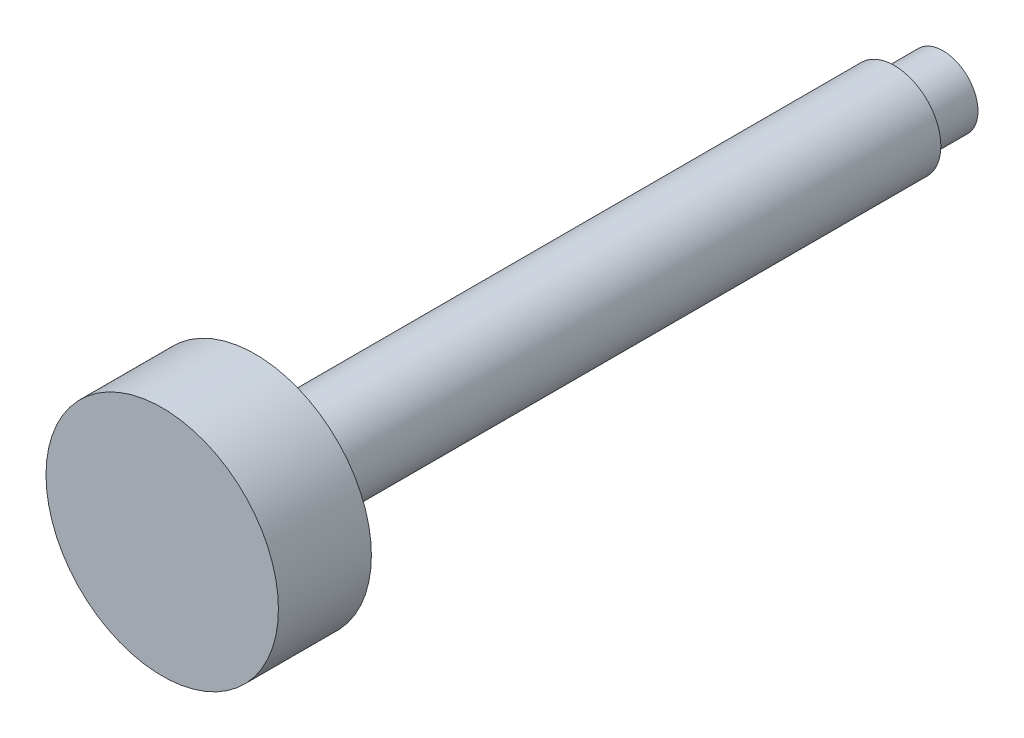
ISO-10303-21;
HEADER;
FILE_DESCRIPTION(('STEP AP214'),'2;1');
FILE_NAME('part.step','',(''),(''),'','','');
FILE_SCHEMA(('AUTOMOTIVE_DESIGN { 1 0 10303 214 1 1 1 1 }'));
ENDSEC;
DATA;
#1=APPLICATION_CONTEXT('core data for automotive mechanical design processes');
#2=APPLICATION_PROTOCOL_DEFINITION('international standard','automotive_design',2000,#1);
#3=PRODUCT_CONTEXT('',#1,'mechanical');
#4=PRODUCT('Part','Part','',(#3));
#5=PRODUCT_RELATED_PRODUCT_CATEGORY('part','',(#4));
#6=PRODUCT_DEFINITION_FORMATION('','',#4);
#7=PRODUCT_DEFINITION_CONTEXT('part definition',#1,'design');
#8=PRODUCT_DEFINITION('design','',#6,#7);
#9=PRODUCT_DEFINITION_SHAPE('','',#8);
#10=(LENGTH_UNIT() NAMED_UNIT(*) SI_UNIT(.MILLI.,.METRE.));
#11=(NAMED_UNIT(*) PLANE_ANGLE_UNIT() SI_UNIT($,.RADIAN.));
#12=(NAMED_UNIT(*) SI_UNIT($,.STERADIAN.) SOLID_ANGLE_UNIT());
#13=UNCERTAINTY_MEASURE_WITH_UNIT(LENGTH_MEASURE(1.E-05),#10,'distance_accuracy_value','');
#14=(GEOMETRIC_REPRESENTATION_CONTEXT(3) GLOBAL_UNCERTAINTY_ASSIGNED_CONTEXT((#13)) GLOBAL_UNIT_ASSIGNED_CONTEXT((#10,
#11,#12)) REPRESENTATION_CONTEXT('',''));
#15=CARTESIAN_POINT('',(0.,0.,0.));
#16=DIRECTION('',(0.,0.,1.));
#17=DIRECTION('',(1.,0.,0.));
#18=AXIS2_PLACEMENT_3D('',#15,#16,#17);
#19=CARTESIAN_POINT('',(0.,0.,6.));
#20=DIRECTION('',(0.,0.,1.));
#21=DIRECTION('',(1.,0.,0.));
#22=AXIS2_PLACEMENT_3D('',#19,#20,#21);
#23=SPHERICAL_SURFACE('',#22,6.);
#24=CARTESIAN_POINT('',(0.,0.,0.803847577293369));
#25=DIRECTION('',(0.,0.,1.));
#26=DIRECTION('',(1.,0.,0.));
#27=AXIS2_PLACEMENT_3D('',#24,#25,#26);
#28=CIRCLE('',#27,3.);
#29=CARTESIAN_POINT('',(3.,0.,0.803847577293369));
#30=VERTEX_POINT('',#29);
#31=EDGE_CURVE('E8',#30,#30,#28,.T.);
#32=ORIENTED_EDGE('',*,*,#31,.F.);
#33=EDGE_LOOP('',(#32));
#34=FACE_BOUND('',#33,.T.);
#35=ADVANCED_FACE('F12',(#34),#23,.T.);
#36=CARTESIAN_POINT('',(0.,0.,40.017563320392));
#37=DIRECTION('',(0.,0.,1.));
#38=DIRECTION('',(1.,0.,0.));
#39=AXIS2_PLACEMENT_3D('',#36,#37,#38);
#40=CYLINDRICAL_SURFACE('',#39,3.);
#41=CARTESIAN_POINT('',(0.,0.,5.));
#42=DIRECTION('',(0.,0.,1.));
#43=DIRECTION('',(1.,0.,0.));
#44=AXIS2_PLACEMENT_3D('',#41,#42,#43);
#45=CIRCLE('',#44,3.);
#46=CARTESIAN_POINT('',(3.,0.,5.));
#47=VERTEX_POINT('',#46);
#48=EDGE_CURVE('E18',#47,#47,#45,.T.);
#49=ORIENTED_EDGE('',*,*,#48,.F.);
#50=EDGE_LOOP('',(#49));
#51=FACE_BOUND('',#50,.T.);
#52=ORIENTED_EDGE('',*,*,#31,.T.);
#53=EDGE_LOOP('',(#52));
#54=FACE_BOUND('',#53,.T.);
#55=ADVANCED_FACE('F60',(#51,#54),#40,.T.);
#56=CARTESIAN_POINT('',(-3.,0.,5.));
#57=DIRECTION('',(0.,0.,1.));
#58=DIRECTION('',(1.,0.,0.));
#59=AXIS2_PLACEMENT_3D('',#56,#57,#58);
#60=PLANE('',#59);
#61=CARTESIAN_POINT('',(0.,0.,5.));
#62=DIRECTION('',(0.,0.,1.));
#63=DIRECTION('',(1.,0.,0.));
#64=AXIS2_PLACEMENT_3D('',#61,#62,#63);
#65=CIRCLE('',#64,4.);
#66=CARTESIAN_POINT('',(4.,0.,5.));
#67=VERTEX_POINT('',#66);
#68=EDGE_CURVE('E22',#67,#67,#65,.T.);
#69=ORIENTED_EDGE('',*,*,#68,.F.);
#70=EDGE_LOOP('',(#69));
#71=FACE_BOUND('',#70,.T.);
#72=ORIENTED_EDGE('',*,*,#48,.T.);
#73=EDGE_LOOP('',(#72));
#74=FACE_BOUND('',#73,.T.);
#75=ADVANCED_FACE('F55',(#71,#74),#60,.F.);
#76=CARTESIAN_POINT('',(0.,0.,40.017563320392));
#77=DIRECTION('',(0.,0.,1.));
#78=DIRECTION('',(1.,0.,0.));
#79=AXIS2_PLACEMENT_3D('',#76,#77,#78);
#80=CYLINDRICAL_SURFACE('',#79,4.);
#81=CARTESIAN_POINT('',(0.,0.,60.));
#82=DIRECTION('',(0.,0.,1.));
#83=DIRECTION('',(1.,0.,0.));
#84=AXIS2_PLACEMENT_3D('',#81,#82,#83);
#85=CIRCLE('',#84,4.);
#86=CARTESIAN_POINT('',(4.,0.,60.));
#87=VERTEX_POINT('',#86);
#88=EDGE_CURVE('E26',#87,#87,#85,.T.);
#89=ORIENTED_EDGE('',*,*,#88,.F.);
#90=EDGE_LOOP('',(#89));
#91=FACE_BOUND('',#90,.T.);
#92=ORIENTED_EDGE('',*,*,#68,.T.);
#93=EDGE_LOOP('',(#92));
#94=FACE_BOUND('',#93,.T.);
#95=ADVANCED_FACE('F49',(#91,#94),#80,.T.);
#96=CARTESIAN_POINT('',(-4.,0.,60.));
#97=DIRECTION('',(0.,0.,1.));
#98=DIRECTION('',(1.,0.,0.));
#99=AXIS2_PLACEMENT_3D('',#96,#97,#98);
#100=PLANE('',#99);
#101=CARTESIAN_POINT('',(0.,0.,60.));
#102=DIRECTION('',(0.,0.,1.));
#103=DIRECTION('',(1.,0.,0.));
#104=AXIS2_PLACEMENT_3D('',#101,#102,#103);
#105=CIRCLE('',#104,10.);
#106=CARTESIAN_POINT('',(10.,0.,60.));
#107=VERTEX_POINT('',#106);
#108=EDGE_CURVE('E31',#107,#107,#105,.T.);
#109=ORIENTED_EDGE('',*,*,#108,.F.);
#110=EDGE_LOOP('',(#109));
#111=FACE_BOUND('',#110,.T.);
#112=ORIENTED_EDGE('',*,*,#88,.T.);
#113=EDGE_LOOP('',(#112));
#114=FACE_BOUND('',#113,.T.);
#115=ADVANCED_FACE('F43',(#111,#114),#100,.F.);
#116=CARTESIAN_POINT('',(0.,0.,40.017563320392));
#117=DIRECTION('',(0.,0.,1.));
#118=DIRECTION('',(1.,0.,0.));
#119=AXIS2_PLACEMENT_3D('',#116,#117,#118);
#120=CYLINDRICAL_SURFACE('',#119,10.);
#121=CARTESIAN_POINT('',(0.,0.,68.));
#122=DIRECTION('',(0.,0.,1.));
#123=DIRECTION('',(1.,0.,0.));
#124=AXIS2_PLACEMENT_3D('',#121,#122,#123);
#125=CIRCLE('',#124,10.);
#126=CARTESIAN_POINT('',(10.,0.,68.));
#127=VERTEX_POINT('',#126);
#128=EDGE_CURVE('E34',#127,#127,#125,.T.);
#129=ORIENTED_EDGE('',*,*,#128,.F.);
#130=EDGE_LOOP('',(#129));
#131=FACE_BOUND('',#130,.T.);
#132=ORIENTED_EDGE('',*,*,#108,.T.);
#133=EDGE_LOOP('',(#132));
#134=FACE_BOUND('',#133,.T.);
#135=ADVANCED_FACE('F40',(#131,#134),#120,.T.);
#136=CARTESIAN_POINT('',(-10.,0.,68.));
#137=DIRECTION('',(0.,0.,-1.));
#138=DIRECTION('',(-1.,0.,0.));
#139=AXIS2_PLACEMENT_3D('',#136,#137,#138);
#140=PLANE('',#139);
#141=ORIENTED_EDGE('',*,*,#128,.T.);
#142=EDGE_LOOP('',(#141));
#143=FACE_BOUND('',#142,.T.);
#144=ADVANCED_FACE('F38',(#143),#140,.F.);
#145=CLOSED_SHELL('',(#35,#55,#75,#95,#115,#135,#144));
#146=MANIFOLD_SOLID_BREP('B1',#145);
#147=ADVANCED_BREP_SHAPE_REPRESENTATION('',(#18,#146),#14);
#148=SHAPE_DEFINITION_REPRESENTATION(#9,#147);
ENDSEC;
END-ISO-10303-21;
